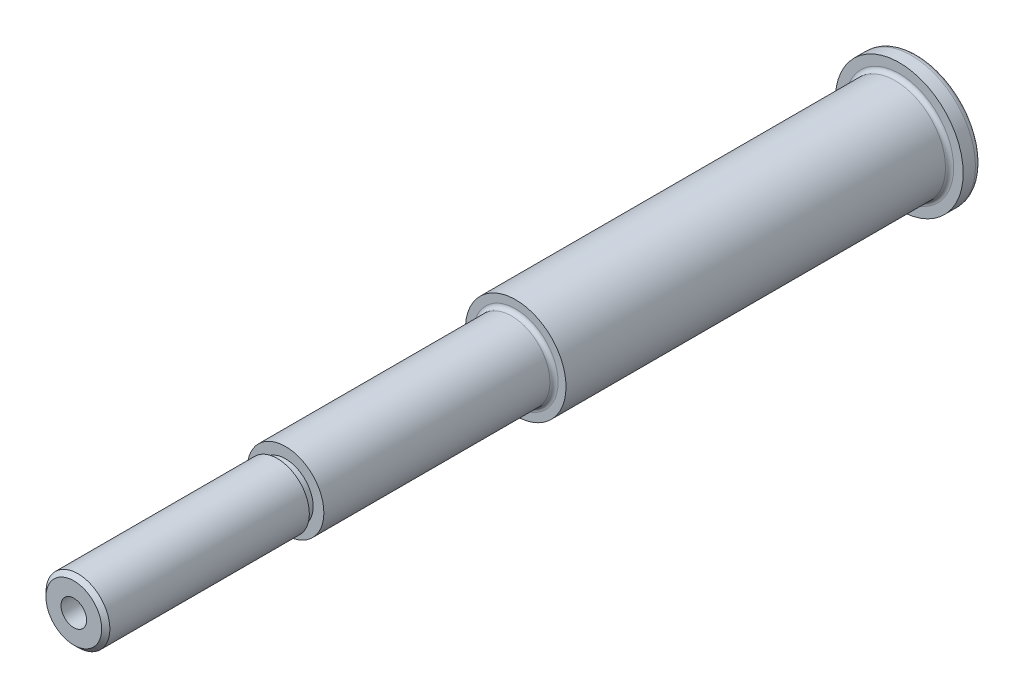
ISO-10303-21;
HEADER;
FILE_DESCRIPTION(('STEP AP214'),'2;1');
FILE_NAME('part.step','',(''),(''),'','','');
FILE_SCHEMA(('AUTOMOTIVE_DESIGN { 1 0 10303 214 1 1 1 1 }'));
ENDSEC;
DATA;
#1=APPLICATION_CONTEXT('core data for automotive mechanical design processes');
#2=APPLICATION_PROTOCOL_DEFINITION('international standard','automotive_design',2000,#1);
#3=PRODUCT_CONTEXT('',#1,'mechanical');
#4=PRODUCT('Part','Part','',(#3));
#5=PRODUCT_RELATED_PRODUCT_CATEGORY('part','',(#4));
#6=PRODUCT_DEFINITION_FORMATION('','',#4);
#7=PRODUCT_DEFINITION_CONTEXT('part definition',#1,'design');
#8=PRODUCT_DEFINITION('design','',#6,#7);
#9=PRODUCT_DEFINITION_SHAPE('','',#8);
#10=(LENGTH_UNIT() NAMED_UNIT(*) SI_UNIT(.MILLI.,.METRE.));
#11=(NAMED_UNIT(*) PLANE_ANGLE_UNIT() SI_UNIT($,.RADIAN.));
#12=(NAMED_UNIT(*) SI_UNIT($,.STERADIAN.) SOLID_ANGLE_UNIT());
#13=UNCERTAINTY_MEASURE_WITH_UNIT(LENGTH_MEASURE(1.E-05),#10,'distance_accuracy_value','');
#14=(GEOMETRIC_REPRESENTATION_CONTEXT(3) GLOBAL_UNCERTAINTY_ASSIGNED_CONTEXT((#13)) GLOBAL_UNIT_ASSIGNED_CONTEXT((#10,
#11,#12)) REPRESENTATION_CONTEXT('',''));
#15=CARTESIAN_POINT('',(0.,0.,0.));
#16=DIRECTION('',(0.,0.,1.));
#17=DIRECTION('',(1.,0.,0.));
#18=AXIS2_PLACEMENT_3D('',#15,#16,#17);
#19=CARTESIAN_POINT('',(0.,6.92149999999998,209.55));
#20=DIRECTION('',(0.,0.,-1.));
#21=DIRECTION('',(-1.,0.,0.));
#22=AXIS2_PLACEMENT_3D('',#19,#20,#21);
#23=PLANE('',#22);
#24=CARTESIAN_POINT('',(0.,0.,209.55));
#25=DIRECTION('',(0.,0.,1.));
#26=DIRECTION('',(1.,0.,0.));
#27=AXIS2_PLACEMENT_3D('',#24,#25,#26);
#28=CIRCLE('',#27,3.175);
#29=CARTESIAN_POINT('',(3.175,0.,209.55));
#30=VERTEX_POINT('',#29);
#31=EDGE_CURVE('E78',#30,#30,#28,.T.);
#32=ORIENTED_EDGE('',*,*,#31,.F.);
#33=EDGE_LOOP('',(#32));
#34=FACE_BOUND('',#33,.T.);
#35=CARTESIAN_POINT('',(0.,0.,209.55));
#36=DIRECTION('',(0.,0.,1.));
#37=DIRECTION('',(1.,0.,0.));
#38=AXIS2_PLACEMENT_3D('',#35,#36,#37);
#39=CIRCLE('',#38,6.92149999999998);
#40=CARTESIAN_POINT('',(6.92149999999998,0.,209.55));
#41=VERTEX_POINT('',#40);
#42=EDGE_CURVE('E10',#41,#41,#39,.T.);
#43=ORIENTED_EDGE('',*,*,#42,.T.);
#44=EDGE_LOOP('',(#43));
#45=FACE_BOUND('',#44,.T.);
#46=ADVANCED_FACE('F26',(#34,#45),#23,.F.);
#47=CARTESIAN_POINT('',(0.,0.,208.534));
#48=DIRECTION('',(0.,0.,-1.));
#49=DIRECTION('',(-1.,0.,0.));
#50=AXIS2_PLACEMENT_3D('',#47,#48,#49);
#51=CONICAL_SURFACE('',#50,7.93749999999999,0.785398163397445);
#52=ORIENTED_EDGE('',*,*,#42,.F.);
#53=EDGE_LOOP('',(#52));
#54=FACE_BOUND('',#53,.T.);
#55=CARTESIAN_POINT('',(0.,0.,208.534));
#56=DIRECTION('',(0.,0.,1.));
#57=DIRECTION('',(1.,0.,0.));
#58=AXIS2_PLACEMENT_3D('',#55,#56,#57);
#59=CIRCLE('',#58,7.93749999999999);
#60=CARTESIAN_POINT('',(7.93749999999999,0.,208.534));
#61=VERTEX_POINT('',#60);
#62=EDGE_CURVE('E32',#61,#61,#59,.T.);
#63=ORIENTED_EDGE('',*,*,#62,.T.);
#64=EDGE_LOOP('',(#63));
#65=FACE_BOUND('',#64,.T.);
#66=ADVANCED_FACE('F85',(#54,#65),#51,.T.);
#67=CARTESIAN_POINT('',(0.,0.,0.));
#68=DIRECTION('',(0.,0.,1.));
#69=DIRECTION('',(1.,0.,0.));
#70=AXIS2_PLACEMENT_3D('',#67,#68,#69);
#71=CYLINDRICAL_SURFACE('',#70,7.93749999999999);
#72=ORIENTED_EDGE('',*,*,#62,.F.);
#73=EDGE_LOOP('',(#72));
#74=FACE_BOUND('',#73,.T.);
#75=CARTESIAN_POINT('',(0.,0.,159.004));
#76=DIRECTION('',(0.,0.,1.));
#77=DIRECTION('',(1.,0.,0.));
#78=AXIS2_PLACEMENT_3D('',#75,#76,#77);
#79=CIRCLE('',#78,7.9375);
#80=CARTESIAN_POINT('',(7.9375,0.,159.004));
#81=VERTEX_POINT('',#80);
#82=EDGE_CURVE('E36',#81,#81,#79,.T.);
#83=ORIENTED_EDGE('',*,*,#82,.T.);
#84=EDGE_LOOP('',(#83));
#85=FACE_BOUND('',#84,.T.);
#86=ADVANCED_FACE('F91',(#74,#85),#71,.T.);
#87=CARTESIAN_POINT('',(0.,6.858,159.004));
#88=DIRECTION('',(0.,0.,1.));
#89=DIRECTION('',(1.,0.,0.));
#90=AXIS2_PLACEMENT_3D('',#87,#88,#89);
#91=PLANE('',#90);
#92=ORIENTED_EDGE('',*,*,#82,.F.);
#93=EDGE_LOOP('',(#92));
#94=FACE_BOUND('',#93,.T.);
#95=CARTESIAN_POINT('',(0.,0.,159.004));
#96=DIRECTION('',(0.,0.,1.));
#97=DIRECTION('',(1.,0.,0.));
#98=AXIS2_PLACEMENT_3D('',#95,#96,#97);
#99=CIRCLE('',#98,6.858);
#100=CARTESIAN_POINT('',(6.858,0.,159.004));
#101=VERTEX_POINT('',#100);
#102=EDGE_CURVE('E40',#101,#101,#99,.T.);
#103=ORIENTED_EDGE('',*,*,#102,.T.);
#104=EDGE_LOOP('',(#103));
#105=FACE_BOUND('',#104,.T.);
#106=ADVANCED_FACE('F96',(#94,#105),#91,.F.);
#107=CARTESIAN_POINT('',(0.,0.,0.));
#108=DIRECTION('',(0.,0.,1.));
#109=DIRECTION('',(1.,0.,0.));
#110=AXIS2_PLACEMENT_3D('',#107,#108,#109);
#111=CYLINDRICAL_SURFACE('',#110,6.858);
#112=ORIENTED_EDGE('',*,*,#102,.F.);
#113=EDGE_LOOP('',(#112));
#114=FACE_BOUND('',#113,.T.);
#115=CARTESIAN_POINT('',(0.,0.,156.972));
#116=DIRECTION('',(0.,0.,1.));
#117=DIRECTION('',(1.,0.,0.));
#118=AXIS2_PLACEMENT_3D('',#115,#116,#117);
#119=CIRCLE('',#118,6.858);
#120=CARTESIAN_POINT('',(6.858,0.,156.972));
#121=VERTEX_POINT('',#120);
#122=EDGE_CURVE('E45',#121,#121,#119,.T.);
#123=ORIENTED_EDGE('',*,*,#122,.T.);
#124=EDGE_LOOP('',(#123));
#125=FACE_BOUND('',#124,.T.);
#126=ADVANCED_FACE('F102',(#114,#125),#111,.T.);
#127=CARTESIAN_POINT('',(0.,9.51229999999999,156.972));
#128=DIRECTION('',(0.,0.,-1.));
#129=DIRECTION('',(-1.,0.,0.));
#130=AXIS2_PLACEMENT_3D('',#127,#128,#129);
#131=PLANE('',#130);
#132=ORIENTED_EDGE('',*,*,#122,.F.);
#133=EDGE_LOOP('',(#132));
#134=FACE_BOUND('',#133,.T.);
#135=CARTESIAN_POINT('',(0.,0.,156.972));
#136=DIRECTION('',(0.,0.,1.));
#137=DIRECTION('',(1.,0.,0.));
#138=AXIS2_PLACEMENT_3D('',#135,#136,#137);
#139=CIRCLE('',#138,9.51229999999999);
#140=CARTESIAN_POINT('',(9.51229999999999,0.,156.972));
#141=VERTEX_POINT('',#140);
#142=EDGE_CURVE('E48',#141,#141,#139,.T.);
#143=ORIENTED_EDGE('',*,*,#142,.T.);
#144=EDGE_LOOP('',(#143));
#145=FACE_BOUND('',#144,.T.);
#146=ADVANCED_FACE('F106',(#134,#145),#131,.F.);
#147=CARTESIAN_POINT('',(0.,0.,0.));
#148=DIRECTION('',(0.,0.,1.));
#149=DIRECTION('',(1.,0.,0.));
#150=AXIS2_PLACEMENT_3D('',#147,#148,#149);
#151=CYLINDRICAL_SURFACE('',#150,9.51229999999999);
#152=ORIENTED_EDGE('',*,*,#142,.F.);
#153=EDGE_LOOP('',(#152));
#154=FACE_BOUND('',#153,.T.);
#155=CARTESIAN_POINT('',(0.,0.,100.838));
#156=DIRECTION('',(0.,0.,1.));
#157=DIRECTION('',(1.,0.,0.));
#158=AXIS2_PLACEMENT_3D('',#155,#156,#157);
#159=CIRCLE('',#158,9.5123);
#160=CARTESIAN_POINT('',(9.5123,0.,100.838));
#161=VERTEX_POINT('',#160);
#162=EDGE_CURVE('E51',#161,#161,#159,.T.);
#163=ORIENTED_EDGE('',*,*,#162,.T.);
#164=EDGE_LOOP('',(#163));
#165=FACE_BOUND('',#164,.T.);
#166=ADVANCED_FACE('F110',(#154,#165),#151,.T.);
#167=CARTESIAN_POINT('',(0.,0.,100.838));
#168=DIRECTION('',(0.,0.,1.));
#169=DIRECTION('',(1.,0.,0.));
#170=AXIS2_PLACEMENT_3D('',#167,#168,#169);
#171=TOROIDAL_SURFACE('',#170,10.5283,1.016);
#172=ORIENTED_EDGE('',*,*,#162,.F.);
#173=EDGE_LOOP('',(#172));
#174=FACE_BOUND('',#173,.T.);
#175=CARTESIAN_POINT('',(0.,0.,99.822));
#176=DIRECTION('',(0.,0.,1.));
#177=DIRECTION('',(1.,0.,0.));
#178=AXIS2_PLACEMENT_3D('',#175,#176,#177);
#179=CIRCLE('',#178,10.5283);
#180=CARTESIAN_POINT('',(10.5283,0.,99.822));
#181=VERTEX_POINT('',#180);
#182=EDGE_CURVE('E54',#181,#181,#179,.T.);
#183=ORIENTED_EDGE('',*,*,#182,.T.);
#184=EDGE_LOOP('',(#183));
#185=FACE_BOUND('',#184,.T.);
#186=ADVANCED_FACE('F114',(#174,#185),#171,.F.);
#187=CARTESIAN_POINT('',(0.,12.4968,99.822));
#188=DIRECTION('',(0.,0.,-1.));
#189=DIRECTION('',(-1.,0.,0.));
#190=AXIS2_PLACEMENT_3D('',#187,#188,#189);
#191=PLANE('',#190);
#192=ORIENTED_EDGE('',*,*,#182,.F.);
#193=EDGE_LOOP('',(#192));
#194=FACE_BOUND('',#193,.T.);
#195=CARTESIAN_POINT('',(0.,0.,99.822));
#196=DIRECTION('',(0.,0.,1.));
#197=DIRECTION('',(1.,0.,0.));
#198=AXIS2_PLACEMENT_3D('',#195,#196,#197);
#199=CIRCLE('',#198,12.4968);
#200=CARTESIAN_POINT('',(12.4968,0.,99.822));
#201=VERTEX_POINT('',#200);
#202=EDGE_CURVE('E57',#201,#201,#199,.T.);
#203=ORIENTED_EDGE('',*,*,#202,.T.);
#204=EDGE_LOOP('',(#203));
#205=FACE_BOUND('',#204,.T.);
#206=ADVANCED_FACE('F118',(#194,#205),#191,.F.);
#207=CARTESIAN_POINT('',(0.,0.,0.));
#208=DIRECTION('',(0.,0.,1.));
#209=DIRECTION('',(1.,0.,0.));
#210=AXIS2_PLACEMENT_3D('',#207,#208,#209);
#211=CYLINDRICAL_SURFACE('',#210,12.4968);
#212=ORIENTED_EDGE('',*,*,#202,.F.);
#213=EDGE_LOOP('',(#212));
#214=FACE_BOUND('',#213,.T.);
#215=CARTESIAN_POINT('',(0.,0.,5.588));
#216=DIRECTION('',(0.,0.,1.));
#217=DIRECTION('',(1.,0.,0.));
#218=AXIS2_PLACEMENT_3D('',#215,#216,#217);
#219=CIRCLE('',#218,12.4968);
#220=CARTESIAN_POINT('',(12.4968,0.,5.588));
#221=VERTEX_POINT('',#220);
#222=EDGE_CURVE('E60',#221,#221,#219,.T.);
#223=ORIENTED_EDGE('',*,*,#222,.T.);
#224=EDGE_LOOP('',(#223));
#225=FACE_BOUND('',#224,.T.);
#226=ADVANCED_FACE('F122',(#214,#225),#211,.T.);
#227=CARTESIAN_POINT('',(0.,0.,5.588));
#228=DIRECTION('',(0.,0.,1.));
#229=DIRECTION('',(1.,0.,0.));
#230=AXIS2_PLACEMENT_3D('',#227,#228,#229);
#231=TOROIDAL_SURFACE('',#230,13.5128,1.016);
#232=ORIENTED_EDGE('',*,*,#222,.F.);
#233=EDGE_LOOP('',(#232));
#234=FACE_BOUND('',#233,.T.);
#235=CARTESIAN_POINT('',(0.,0.,4.572));
#236=DIRECTION('',(0.,0.,1.));
#237=DIRECTION('',(1.,0.,0.));
#238=AXIS2_PLACEMENT_3D('',#235,#236,#237);
#239=CIRCLE('',#238,13.5128);
#240=CARTESIAN_POINT('',(13.5128,0.,4.572));
#241=VERTEX_POINT('',#240);
#242=EDGE_CURVE('E63',#241,#241,#239,.T.);
#243=ORIENTED_EDGE('',*,*,#242,.T.);
#244=EDGE_LOOP('',(#243));
#245=FACE_BOUND('',#244,.T.);
#246=ADVANCED_FACE('F126',(#234,#245),#231,.F.);
#247=CARTESIAN_POINT('',(0.,15.875,4.572));
#248=DIRECTION('',(0.,0.,-1.));
#249=DIRECTION('',(-1.,0.,0.));
#250=AXIS2_PLACEMENT_3D('',#247,#248,#249);
#251=PLANE('',#250);
#252=ORIENTED_EDGE('',*,*,#242,.F.);
#253=EDGE_LOOP('',(#252));
#254=FACE_BOUND('',#253,.T.);
#255=CARTESIAN_POINT('',(0.,0.,4.572));
#256=DIRECTION('',(0.,0.,1.));
#257=DIRECTION('',(1.,0.,0.));
#258=AXIS2_PLACEMENT_3D('',#255,#256,#257);
#259=CIRCLE('',#258,15.875);
#260=CARTESIAN_POINT('',(15.875,0.,4.572));
#261=VERTEX_POINT('',#260);
#262=EDGE_CURVE('E66',#261,#261,#259,.T.);
#263=ORIENTED_EDGE('',*,*,#262,.T.);
#264=EDGE_LOOP('',(#263));
#265=FACE_BOUND('',#264,.T.);
#266=ADVANCED_FACE('F130',(#254,#265),#251,.F.);
#267=CARTESIAN_POINT('',(0.,0.,0.));
#268=DIRECTION('',(0.,0.,1.));
#269=DIRECTION('',(1.,0.,0.));
#270=AXIS2_PLACEMENT_3D('',#267,#268,#269);
#271=CYLINDRICAL_SURFACE('',#270,15.875);
#272=ORIENTED_EDGE('',*,*,#262,.F.);
#273=EDGE_LOOP('',(#272));
#274=FACE_BOUND('',#273,.T.);
#275=CARTESIAN_POINT('',(0.,0.,1.524));
#276=DIRECTION('',(0.,0.,1.));
#277=DIRECTION('',(1.,0.,0.));
#278=AXIS2_PLACEMENT_3D('',#275,#276,#277);
#279=CIRCLE('',#278,15.875);
#280=CARTESIAN_POINT('',(15.875,0.,1.524));
#281=VERTEX_POINT('',#280);
#282=EDGE_CURVE('E69',#281,#281,#279,.T.);
#283=ORIENTED_EDGE('',*,*,#282,.T.);
#284=EDGE_LOOP('',(#283));
#285=FACE_BOUND('',#284,.T.);
#286=ADVANCED_FACE('F134',(#274,#285),#271,.T.);
#287=CARTESIAN_POINT('',(0.,0.,1.524));
#288=DIRECTION('',(0.,0.,1.));
#289=DIRECTION('',(1.,0.,0.));
#290=AXIS2_PLACEMENT_3D('',#287,#288,#289);
#291=TOROIDAL_SURFACE('',#290,14.351,1.524);
#292=ORIENTED_EDGE('',*,*,#282,.F.);
#293=EDGE_LOOP('',(#292));
#294=FACE_BOUND('',#293,.T.);
#295=CARTESIAN_POINT('',(0.,0.,0.));
#296=DIRECTION('',(0.,0.,1.));
#297=DIRECTION('',(1.,0.,0.));
#298=AXIS2_PLACEMENT_3D('',#295,#296,#297);
#299=CIRCLE('',#298,14.351);
#300=CARTESIAN_POINT('',(14.351,0.,0.));
#301=VERTEX_POINT('',#300);
#302=EDGE_CURVE('E72',#301,#301,#299,.T.);
#303=ORIENTED_EDGE('',*,*,#302,.T.);
#304=EDGE_LOOP('',(#303));
#305=FACE_BOUND('',#304,.T.);
#306=ADVANCED_FACE('F138',(#294,#305),#291,.T.);
#307=CARTESIAN_POINT('',(0.,0.,0.));
#308=DIRECTION('',(0.,0.,1.));
#309=DIRECTION('',(1.,0.,0.));
#310=AXIS2_PLACEMENT_3D('',#307,#308,#309);
#311=PLANE('',#310);
#312=ORIENTED_EDGE('',*,*,#302,.F.);
#313=EDGE_LOOP('',(#312));
#314=FACE_BOUND('',#313,.T.);
#315=ADVANCED_FACE('F142',(#314),#311,.F.);
#316=CARTESIAN_POINT('',(0.,0.,174.625));
#317=DIRECTION('',(0.,0.,1.));
#318=DIRECTION('',(1.,0.,0.));
#319=AXIS2_PLACEMENT_3D('',#316,#317,#318);
#320=CYLINDRICAL_SURFACE('',#319,3.175);
#321=CARTESIAN_POINT('',(0.,0.,174.625));
#322=DIRECTION('',(0.,0.,1.));
#323=DIRECTION('',(1.,0.,0.));
#324=AXIS2_PLACEMENT_3D('',#321,#322,#323);
#325=CIRCLE('',#324,3.175);
#326=CARTESIAN_POINT('',(3.175,0.,174.625));
#327=VERTEX_POINT('',#326);
#328=EDGE_CURVE('E75',#327,#327,#325,.T.);
#329=ORIENTED_EDGE('',*,*,#328,.F.);
#330=EDGE_LOOP('',(#329));
#331=FACE_BOUND('',#330,.T.);
#332=ORIENTED_EDGE('',*,*,#31,.T.);
#333=EDGE_LOOP('',(#332));
#334=FACE_BOUND('',#333,.T.);
#335=ADVANCED_FACE('F82',(#331,#334),#320,.F.);
#336=CARTESIAN_POINT('',(0.,0.,174.625));
#337=DIRECTION('',(0.,0.,1.));
#338=DIRECTION('',(1.,0.,0.));
#339=AXIS2_PLACEMENT_3D('',#336,#337,#338);
#340=PLANE('',#339);
#341=ORIENTED_EDGE('',*,*,#328,.T.);
#342=EDGE_LOOP('',(#341));
#343=FACE_BOUND('',#342,.T.);
#344=ADVANCED_FACE('F147',(#343),#340,.T.);
#345=CLOSED_SHELL('',(#46,#66,#86,#106,#126,#146,#166,#186,#206,#226,#246,#266,#286,#306,#315,
#335,#344));
#346=MANIFOLD_SOLID_BREP('B2',#345);
#347=ADVANCED_BREP_SHAPE_REPRESENTATION('',(#18,#346),#14);
#348=SHAPE_DEFINITION_REPRESENTATION(#9,#347);
ENDSEC;
END-ISO-10303-21;
